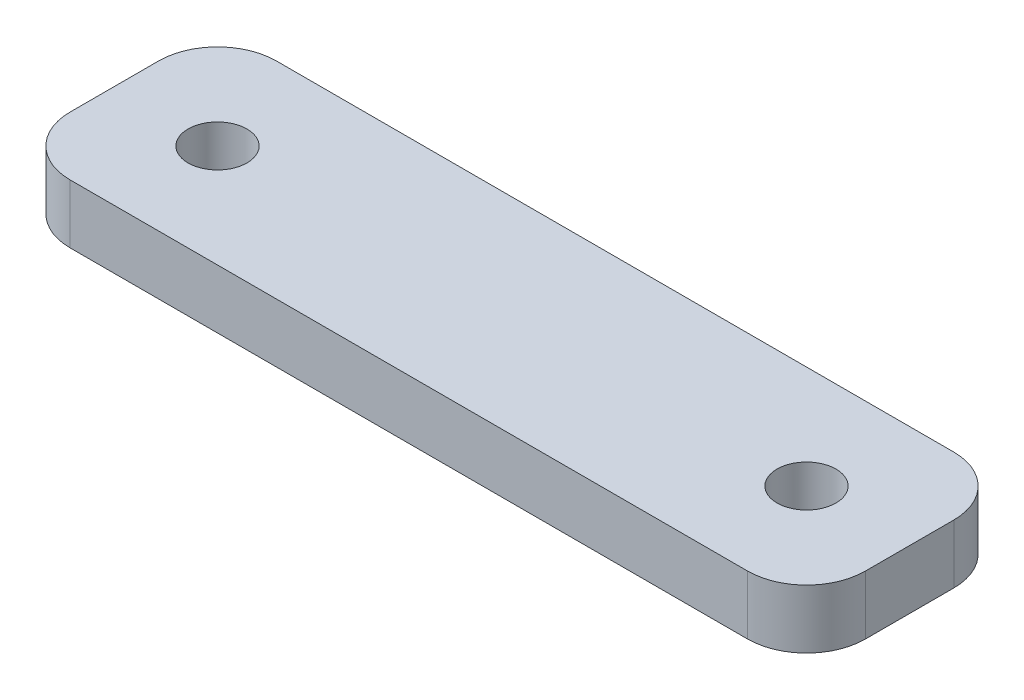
ISO-10303-21;
HEADER;
FILE_DESCRIPTION(('STEP AP214'),'2;1');
FILE_NAME('part.step','',(''),(''),'','','');
FILE_SCHEMA(('AUTOMOTIVE_DESIGN { 1 0 10303 214 1 1 1 1 }'));
ENDSEC;
DATA;
#1=APPLICATION_CONTEXT('core data for automotive mechanical design processes');
#2=APPLICATION_PROTOCOL_DEFINITION('international standard','automotive_design',2000,#1);
#3=PRODUCT_CONTEXT('',#1,'mechanical');
#4=PRODUCT('Part','Part','',(#3));
#5=PRODUCT_RELATED_PRODUCT_CATEGORY('part','',(#4));
#6=PRODUCT_DEFINITION_FORMATION('','',#4);
#7=PRODUCT_DEFINITION_CONTEXT('part definition',#1,'design');
#8=PRODUCT_DEFINITION('design','',#6,#7);
#9=PRODUCT_DEFINITION_SHAPE('','',#8);
#10=(LENGTH_UNIT() NAMED_UNIT(*) SI_UNIT(.MILLI.,.METRE.));
#11=(NAMED_UNIT(*) PLANE_ANGLE_UNIT() SI_UNIT($,.RADIAN.));
#12=(NAMED_UNIT(*) SI_UNIT($,.STERADIAN.) SOLID_ANGLE_UNIT());
#13=UNCERTAINTY_MEASURE_WITH_UNIT(LENGTH_MEASURE(1.E-05),#10,'distance_accuracy_value','');
#14=(GEOMETRIC_REPRESENTATION_CONTEXT(3) GLOBAL_UNCERTAINTY_ASSIGNED_CONTEXT((#13)) GLOBAL_UNIT_ASSIGNED_CONTEXT((#10,
#11,#12)) REPRESENTATION_CONTEXT('',''));
#15=CARTESIAN_POINT('',(0.,0.,0.));
#16=DIRECTION('',(0.,0.,1.));
#17=DIRECTION('',(1.,0.,0.));
#18=AXIS2_PLACEMENT_3D('',#15,#16,#17);
#19=CARTESIAN_POINT('',(-17.145,2.54,-4.445));
#20=DIRECTION('',(1.,0.,0.));
#21=DIRECTION('',(0.,0.,-1.));
#22=AXIS2_PLACEMENT_3D('',#19,#20,#21);
#23=PLANE('',#22);
#24=DIRECTION('',(0.,0.,1.));
#25=VECTOR('',#24,1.);
#26=CARTESIAN_POINT('',(-17.145,0.,-4.445));
#27=LINE('',#26,#25);
#28=CARTESIAN_POINT('',(-17.145,0.,-1.905));
#29=VERTEX_POINT('',#28);
#30=CARTESIAN_POINT('',(-17.145,0.,1.905));
#31=VERTEX_POINT('',#30);
#32=EDGE_CURVE('E158',#29,#31,#27,.T.);
#33=ORIENTED_EDGE('',*,*,#32,.T.);
#34=DIRECTION('',(0.,-1.,0.));
#35=VECTOR('',#34,1.);
#36=CARTESIAN_POINT('',(-17.145,2.54,1.905));
#37=LINE('',#36,#35);
#38=CARTESIAN_POINT('',(-17.145,2.54,1.905));
#39=VERTEX_POINT('',#38);
#40=EDGE_CURVE('E11',#31,#39,#37,.F.);
#41=ORIENTED_EDGE('',*,*,#40,.T.);
#42=DIRECTION('',(0.,0.,1.));
#43=VECTOR('',#42,1.);
#44=CARTESIAN_POINT('',(-17.145,2.54,-4.445));
#45=LINE('',#44,#43);
#46=CARTESIAN_POINT('',(-17.145,2.54,-1.905));
#47=VERTEX_POINT('',#46);
#48=EDGE_CURVE('E126',#47,#39,#45,.T.);
#49=ORIENTED_EDGE('',*,*,#48,.F.);
#50=DIRECTION('',(0.,-1.,0.));
#51=VECTOR('',#50,1.);
#52=CARTESIAN_POINT('',(-17.145,2.54,-1.905));
#53=LINE('',#52,#51);
#54=EDGE_CURVE('E42',#47,#29,#53,.T.);
#55=ORIENTED_EDGE('',*,*,#54,.T.);
#56=EDGE_LOOP('',(#33,#41,#49,#55));
#57=FACE_BOUND('',#56,.T.);
#58=ADVANCED_FACE('F34',(#57),#23,.F.);
#59=CARTESIAN_POINT('',(-17.145,2.54,4.445));
#60=DIRECTION('',(0.,0.,-1.));
#61=DIRECTION('',(-1.,0.,0.));
#62=AXIS2_PLACEMENT_3D('',#59,#60,#61);
#63=PLANE('',#62);
#64=DIRECTION('',(1.,0.,0.));
#65=VECTOR('',#64,1.);
#66=CARTESIAN_POINT('',(-17.145,0.,4.445));
#67=LINE('',#66,#65);
#68=CARTESIAN_POINT('',(-14.605,0.,4.445));
#69=VERTEX_POINT('',#68);
#70=CARTESIAN_POINT('',(14.605,0.,4.445));
#71=VERTEX_POINT('',#70);
#72=EDGE_CURVE('E131',#69,#71,#67,.T.);
#73=ORIENTED_EDGE('',*,*,#72,.T.);
#74=DIRECTION('',(0.,-1.,0.));
#75=VECTOR('',#74,1.);
#76=CARTESIAN_POINT('',(14.605,2.54,4.445));
#77=LINE('',#76,#75);
#78=CARTESIAN_POINT('',(14.605,2.54,4.445));
#79=VERTEX_POINT('',#78);
#80=EDGE_CURVE('E49',#71,#79,#77,.F.);
#81=ORIENTED_EDGE('',*,*,#80,.T.);
#82=DIRECTION('',(1.,0.,0.));
#83=VECTOR('',#82,1.);
#84=CARTESIAN_POINT('',(-17.145,2.54,4.445));
#85=LINE('',#84,#83);
#86=CARTESIAN_POINT('',(-14.605,2.54,4.445));
#87=VERTEX_POINT('',#86);
#88=EDGE_CURVE('E129',#87,#79,#85,.T.);
#89=ORIENTED_EDGE('',*,*,#88,.F.);
#90=DIRECTION('',(0.,-1.,0.));
#91=VECTOR('',#90,1.);
#92=CARTESIAN_POINT('',(-14.605,2.54,4.445));
#93=LINE('',#92,#91);
#94=EDGE_CURVE('E150',#87,#69,#93,.T.);
#95=ORIENTED_EDGE('',*,*,#94,.T.);
#96=EDGE_LOOP('',(#73,#81,#89,#95));
#97=FACE_BOUND('',#96,.T.);
#98=ADVANCED_FACE('F197',(#97),#63,.F.);
#99=CARTESIAN_POINT('',(17.145,2.54,-4.445));
#100=DIRECTION('',(-1.,0.,0.));
#101=DIRECTION('',(0.,0.,1.));
#102=AXIS2_PLACEMENT_3D('',#99,#100,#101);
#103=PLANE('',#102);
#104=DIRECTION('',(0.,0.,-1.));
#105=VECTOR('',#104,1.);
#106=CARTESIAN_POINT('',(17.145,0.,-4.445));
#107=LINE('',#106,#105);
#108=CARTESIAN_POINT('',(17.145,0.,1.905));
#109=VERTEX_POINT('',#108);
#110=CARTESIAN_POINT('',(17.145,0.,-1.905));
#111=VERTEX_POINT('',#110);
#112=EDGE_CURVE('E127',#109,#111,#107,.T.);
#113=ORIENTED_EDGE('',*,*,#112,.T.);
#114=DIRECTION('',(0.,-1.,0.));
#115=VECTOR('',#114,1.);
#116=CARTESIAN_POINT('',(17.145,2.54,-1.905));
#117=LINE('',#116,#115);
#118=CARTESIAN_POINT('',(17.145,2.54,-1.905));
#119=VERTEX_POINT('',#118);
#120=EDGE_CURVE('E105',#111,#119,#117,.F.);
#121=ORIENTED_EDGE('',*,*,#120,.T.);
#122=DIRECTION('',(0.,0.,-1.));
#123=VECTOR('',#122,1.);
#124=CARTESIAN_POINT('',(17.145,2.54,-4.445));
#125=LINE('',#124,#123);
#126=CARTESIAN_POINT('',(17.145,2.54,1.905));
#127=VERTEX_POINT('',#126);
#128=EDGE_CURVE('E170',#127,#119,#125,.T.);
#129=ORIENTED_EDGE('',*,*,#128,.F.);
#130=DIRECTION('',(0.,-1.,0.));
#131=VECTOR('',#130,1.);
#132=CARTESIAN_POINT('',(17.145,2.54,1.905));
#133=LINE('',#132,#131);
#134=EDGE_CURVE('E110',#127,#109,#133,.T.);
#135=ORIENTED_EDGE('',*,*,#134,.T.);
#136=EDGE_LOOP('',(#113,#121,#129,#135));
#137=FACE_BOUND('',#136,.T.);
#138=ADVANCED_FACE('F194',(#137),#103,.F.);
#139=CARTESIAN_POINT('',(-17.145,2.54,-4.445));
#140=DIRECTION('',(0.,0.,1.));
#141=DIRECTION('',(1.,0.,0.));
#142=AXIS2_PLACEMENT_3D('',#139,#140,#141);
#143=PLANE('',#142);
#144=DIRECTION('',(-1.,0.,0.));
#145=VECTOR('',#144,1.);
#146=CARTESIAN_POINT('',(-17.145,2.54,-4.445));
#147=LINE('',#146,#145);
#148=CARTESIAN_POINT('',(14.605,2.54,-4.445));
#149=VERTEX_POINT('',#148);
#150=CARTESIAN_POINT('',(-14.605,2.54,-4.445));
#151=VERTEX_POINT('',#150);
#152=EDGE_CURVE('E120',#149,#151,#147,.T.);
#153=ORIENTED_EDGE('',*,*,#152,.F.);
#154=DIRECTION('',(0.,-1.,0.));
#155=VECTOR('',#154,1.);
#156=CARTESIAN_POINT('',(14.605,2.54,-4.445));
#157=LINE('',#156,#155);
#158=CARTESIAN_POINT('',(14.605,0.,-4.445));
#159=VERTEX_POINT('',#158);
#160=EDGE_CURVE('E104',#149,#159,#157,.T.);
#161=ORIENTED_EDGE('',*,*,#160,.T.);
#162=DIRECTION('',(-1.,0.,0.));
#163=VECTOR('',#162,1.);
#164=CARTESIAN_POINT('',(-17.145,0.,-4.445));
#165=LINE('',#164,#163);
#166=CARTESIAN_POINT('',(-14.605,0.,-4.445));
#167=VERTEX_POINT('',#166);
#168=EDGE_CURVE('E117',#159,#167,#165,.T.);
#169=ORIENTED_EDGE('',*,*,#168,.T.);
#170=DIRECTION('',(0.,-1.,0.));
#171=VECTOR('',#170,1.);
#172=CARTESIAN_POINT('',(-14.605,2.54,-4.445));
#173=LINE('',#172,#171);
#174=EDGE_CURVE('E122',#167,#151,#173,.F.);
#175=ORIENTED_EDGE('',*,*,#174,.T.);
#176=EDGE_LOOP('',(#153,#161,#169,#175));
#177=FACE_BOUND('',#176,.T.);
#178=ADVANCED_FACE('F116',(#177),#143,.F.);
#179=CARTESIAN_POINT('',(0.,2.54,0.));
#180=DIRECTION('',(0.,1.,0.));
#181=DIRECTION('',(0.,0.,1.));
#182=AXIS2_PLACEMENT_3D('',#179,#180,#181);
#183=PLANE('',#182);
#184=CARTESIAN_POINT('',(-12.7,2.54,0.));
#185=DIRECTION('',(0.,1.,0.));
#186=DIRECTION('',(0.,0.,1.));
#187=AXIS2_PLACEMENT_3D('',#184,#185,#186);
#188=CIRCLE('',#187,1.27);
#189=CARTESIAN_POINT('',(-12.7,2.54,1.27));
#190=VERTEX_POINT('',#189);
#191=EDGE_CURVE('E166',#190,#190,#188,.T.);
#192=ORIENTED_EDGE('',*,*,#191,.F.);
#193=EDGE_LOOP('',(#192));
#194=FACE_BOUND('',#193,.T.);
#195=CARTESIAN_POINT('',(12.7,2.54,0.));
#196=DIRECTION('',(0.,1.,0.));
#197=DIRECTION('',(0.,0.,-1.));
#198=AXIS2_PLACEMENT_3D('',#195,#196,#197);
#199=CIRCLE('',#198,1.27);
#200=CARTESIAN_POINT('',(12.7,2.54,-1.27));
#201=VERTEX_POINT('',#200);
#202=EDGE_CURVE('E174',#201,#201,#199,.T.);
#203=ORIENTED_EDGE('',*,*,#202,.F.);
#204=EDGE_LOOP('',(#203));
#205=FACE_BOUND('',#204,.T.);
#206=ORIENTED_EDGE('',*,*,#128,.T.);
#207=CARTESIAN_POINT('',(14.605,2.54,-1.905));
#208=DIRECTION('',(0.,1.,0.));
#209=DIRECTION('',(0.,0.,1.));
#210=AXIS2_PLACEMENT_3D('',#207,#208,#209);
#211=CIRCLE('',#210,2.54);
#212=EDGE_CURVE('E148',#119,#149,#211,.T.);
#213=ORIENTED_EDGE('',*,*,#212,.T.);
#214=ORIENTED_EDGE('',*,*,#152,.T.);
#215=CARTESIAN_POINT('',(-14.605,2.54,-1.905));
#216=DIRECTION('',(0.,1.,0.));
#217=DIRECTION('',(0.,0.,1.));
#218=AXIS2_PLACEMENT_3D('',#215,#216,#217);
#219=CIRCLE('',#218,2.54);
#220=EDGE_CURVE('E143',#151,#47,#219,.T.);
#221=ORIENTED_EDGE('',*,*,#220,.T.);
#222=ORIENTED_EDGE('',*,*,#48,.T.);
#223=CARTESIAN_POINT('',(-14.605,2.54,1.905));
#224=DIRECTION('',(0.,1.,0.));
#225=DIRECTION('',(0.,0.,1.));
#226=AXIS2_PLACEMENT_3D('',#223,#224,#225);
#227=CIRCLE('',#226,2.54);
#228=EDGE_CURVE('E56',#39,#87,#227,.T.);
#229=ORIENTED_EDGE('',*,*,#228,.T.);
#230=ORIENTED_EDGE('',*,*,#88,.T.);
#231=CARTESIAN_POINT('',(14.605,2.54,1.905));
#232=DIRECTION('',(0.,1.,0.));
#233=DIRECTION('',(0.,0.,1.));
#234=AXIS2_PLACEMENT_3D('',#231,#232,#233);
#235=CIRCLE('',#234,2.54);
#236=EDGE_CURVE('E146',#79,#127,#235,.T.);
#237=ORIENTED_EDGE('',*,*,#236,.T.);
#238=EDGE_LOOP('',(#206,#213,#214,#221,#222,#229,#230,#237));
#239=FACE_BOUND('',#238,.T.);
#240=ADVANCED_FACE('F185',(#194,#205,#239),#183,.T.);
#241=CARTESIAN_POINT('',(0.,0.,0.));
#242=DIRECTION('',(0.,1.,0.));
#243=DIRECTION('',(0.,0.,1.));
#244=AXIS2_PLACEMENT_3D('',#241,#242,#243);
#245=PLANE('',#244);
#246=CARTESIAN_POINT('',(-12.7,0.,0.));
#247=DIRECTION('',(0.,1.,0.));
#248=DIRECTION('',(0.,0.,1.));
#249=AXIS2_PLACEMENT_3D('',#246,#247,#248);
#250=CIRCLE('',#249,1.27);
#251=CARTESIAN_POINT('',(-12.7,0.,1.27));
#252=VERTEX_POINT('',#251);
#253=EDGE_CURVE('E163',#252,#252,#250,.T.);
#254=ORIENTED_EDGE('',*,*,#253,.T.);
#255=EDGE_LOOP('',(#254));
#256=FACE_BOUND('',#255,.T.);
#257=CARTESIAN_POINT('',(12.7,0.,0.));
#258=DIRECTION('',(0.,1.,0.));
#259=DIRECTION('',(0.,0.,-1.));
#260=AXIS2_PLACEMENT_3D('',#257,#258,#259);
#261=CIRCLE('',#260,1.27);
#262=CARTESIAN_POINT('',(12.7,0.,-1.27));
#263=VERTEX_POINT('',#262);
#264=EDGE_CURVE('E177',#263,#263,#261,.T.);
#265=ORIENTED_EDGE('',*,*,#264,.T.);
#266=EDGE_LOOP('',(#265));
#267=FACE_BOUND('',#266,.T.);
#268=ORIENTED_EDGE('',*,*,#168,.F.);
#269=CARTESIAN_POINT('',(14.605,0.,-1.905));
#270=DIRECTION('',(0.,1.,0.));
#271=DIRECTION('',(0.,0.,1.));
#272=AXIS2_PLACEMENT_3D('',#269,#270,#271);
#273=CIRCLE('',#272,2.54);
#274=EDGE_CURVE('E100',#159,#111,#273,.F.);
#275=ORIENTED_EDGE('',*,*,#274,.T.);
#276=ORIENTED_EDGE('',*,*,#112,.F.);
#277=CARTESIAN_POINT('',(14.605,0.,1.905));
#278=DIRECTION('',(0.,1.,0.));
#279=DIRECTION('',(0.,0.,1.));
#280=AXIS2_PLACEMENT_3D('',#277,#278,#279);
#281=CIRCLE('',#280,2.54);
#282=EDGE_CURVE('E111',#109,#71,#281,.F.);
#283=ORIENTED_EDGE('',*,*,#282,.T.);
#284=ORIENTED_EDGE('',*,*,#72,.F.);
#285=CARTESIAN_POINT('',(-14.605,0.,1.905));
#286=DIRECTION('',(0.,1.,0.));
#287=DIRECTION('',(0.,0.,1.));
#288=AXIS2_PLACEMENT_3D('',#285,#286,#287);
#289=CIRCLE('',#288,2.54);
#290=EDGE_CURVE('E137',#69,#31,#289,.F.);
#291=ORIENTED_EDGE('',*,*,#290,.T.);
#292=ORIENTED_EDGE('',*,*,#32,.F.);
#293=CARTESIAN_POINT('',(-14.605,0.,-1.905));
#294=DIRECTION('',(0.,1.,0.));
#295=DIRECTION('',(0.,0.,1.));
#296=AXIS2_PLACEMENT_3D('',#293,#294,#295);
#297=CIRCLE('',#296,2.54);
#298=EDGE_CURVE('E121',#29,#167,#297,.F.);
#299=ORIENTED_EDGE('',*,*,#298,.T.);
#300=EDGE_LOOP('',(#268,#275,#276,#283,#284,#291,#292,#299));
#301=FACE_BOUND('',#300,.T.);
#302=ADVANCED_FACE('F124',(#256,#267,#301),#245,.F.);
#303=CARTESIAN_POINT('',(12.7,0.,0.));
#304=DIRECTION('',(0.,1.,0.));
#305=DIRECTION('',(0.,0.,1.));
#306=AXIS2_PLACEMENT_3D('',#303,#304,#305);
#307=CYLINDRICAL_SURFACE('',#306,1.27);
#308=ORIENTED_EDGE('',*,*,#264,.F.);
#309=EDGE_LOOP('',(#308));
#310=FACE_BOUND('',#309,.T.);
#311=ORIENTED_EDGE('',*,*,#202,.T.);
#312=EDGE_LOOP('',(#311));
#313=FACE_BOUND('',#312,.T.);
#314=ADVANCED_FACE('F245',(#310,#313),#307,.F.);
#315=CARTESIAN_POINT('',(-12.7,0.,0.));
#316=DIRECTION('',(0.,1.,0.));
#317=DIRECTION('',(0.,0.,1.));
#318=AXIS2_PLACEMENT_3D('',#315,#316,#317);
#319=CYLINDRICAL_SURFACE('',#318,1.27);
#320=ORIENTED_EDGE('',*,*,#253,.F.);
#321=EDGE_LOOP('',(#320));
#322=FACE_BOUND('',#321,.T.);
#323=ORIENTED_EDGE('',*,*,#191,.T.);
#324=EDGE_LOOP('',(#323));
#325=FACE_BOUND('',#324,.T.);
#326=ADVANCED_FACE('F183',(#322,#325),#319,.F.);
#327=CARTESIAN_POINT('',(14.605,2.54,-1.905));
#328=DIRECTION('',(0.,-1.,0.));
#329=DIRECTION('',(0.,0.,-1.));
#330=AXIS2_PLACEMENT_3D('',#327,#328,#329);
#331=CYLINDRICAL_SURFACE('',#330,2.54);
#332=ORIENTED_EDGE('',*,*,#212,.F.);
#333=ORIENTED_EDGE('',*,*,#120,.F.);
#334=ORIENTED_EDGE('',*,*,#274,.F.);
#335=ORIENTED_EDGE('',*,*,#160,.F.);
#336=EDGE_LOOP('',(#332,#333,#334,#335));
#337=FACE_BOUND('',#336,.T.);
#338=ADVANCED_FACE('F103',(#337),#331,.T.);
#339=CARTESIAN_POINT('',(14.605,2.54,1.905));
#340=DIRECTION('',(0.,-1.,0.));
#341=DIRECTION('',(0.,0.,-1.));
#342=AXIS2_PLACEMENT_3D('',#339,#340,#341);
#343=CYLINDRICAL_SURFACE('',#342,2.54);
#344=ORIENTED_EDGE('',*,*,#236,.F.);
#345=ORIENTED_EDGE('',*,*,#80,.F.);
#346=ORIENTED_EDGE('',*,*,#282,.F.);
#347=ORIENTED_EDGE('',*,*,#134,.F.);
#348=EDGE_LOOP('',(#344,#345,#346,#347));
#349=FACE_BOUND('',#348,.T.);
#350=ADVANCED_FACE('F196',(#349),#343,.T.);
#351=CARTESIAN_POINT('',(-14.605,2.54,1.905));
#352=DIRECTION('',(0.,-1.,0.));
#353=DIRECTION('',(0.,0.,-1.));
#354=AXIS2_PLACEMENT_3D('',#351,#352,#353);
#355=CYLINDRICAL_SURFACE('',#354,2.54);
#356=ORIENTED_EDGE('',*,*,#228,.F.);
#357=ORIENTED_EDGE('',*,*,#40,.F.);
#358=ORIENTED_EDGE('',*,*,#290,.F.);
#359=ORIENTED_EDGE('',*,*,#94,.F.);
#360=EDGE_LOOP('',(#356,#357,#358,#359));
#361=FACE_BOUND('',#360,.T.);
#362=ADVANCED_FACE('F200',(#361),#355,.T.);
#363=CARTESIAN_POINT('',(-14.605,2.54,-1.905));
#364=DIRECTION('',(0.,-1.,0.));
#365=DIRECTION('',(0.,0.,-1.));
#366=AXIS2_PLACEMENT_3D('',#363,#364,#365);
#367=CYLINDRICAL_SURFACE('',#366,2.54);
#368=ORIENTED_EDGE('',*,*,#220,.F.);
#369=ORIENTED_EDGE('',*,*,#174,.F.);
#370=ORIENTED_EDGE('',*,*,#298,.F.);
#371=ORIENTED_EDGE('',*,*,#54,.F.);
#372=EDGE_LOOP('',(#368,#369,#370,#371));
#373=FACE_BOUND('',#372,.T.);
#374=ADVANCED_FACE('F36',(#373),#367,.T.);
#375=CLOSED_SHELL('',(#58,#98,#138,#178,#240,#302,#314,#326,#338,#350,#362,#374));
#376=MANIFOLD_SOLID_BREP('B2',#375);
#377=ADVANCED_BREP_SHAPE_REPRESENTATION('',(#18,#376),#14);
#378=SHAPE_DEFINITION_REPRESENTATION(#9,#377);
ENDSEC;
END-ISO-10303-21;
